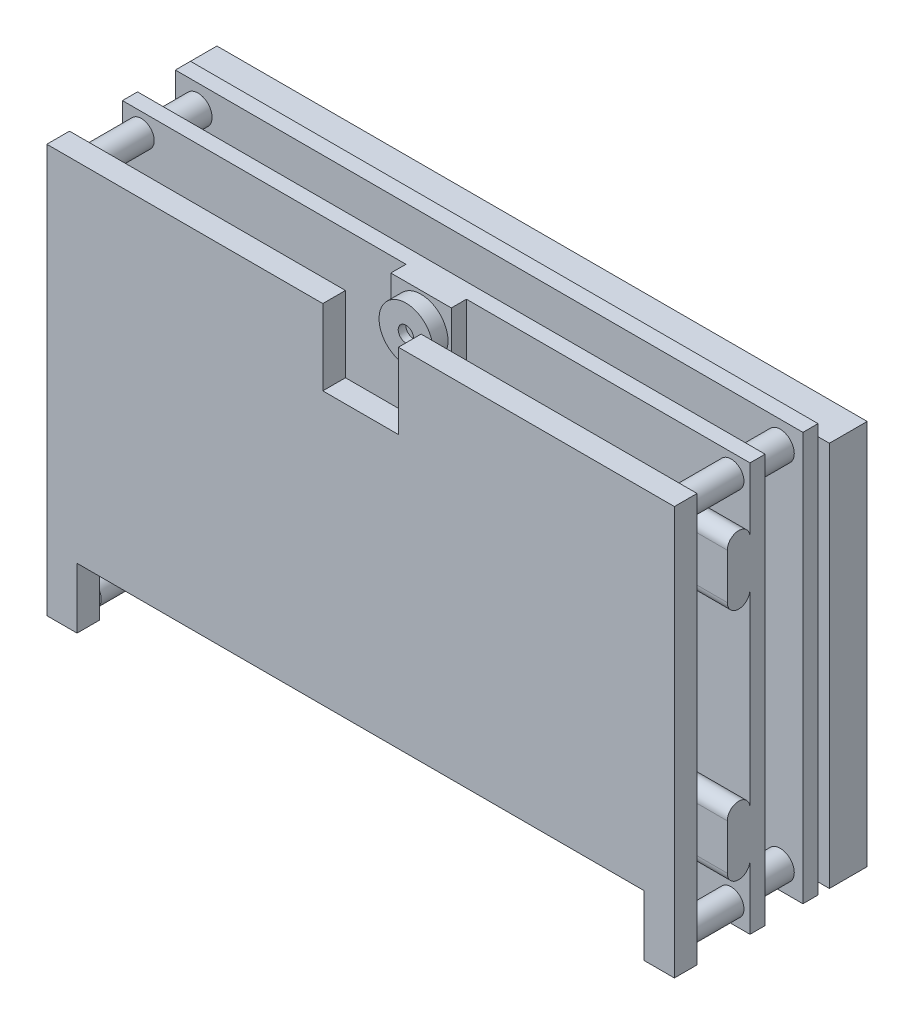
from build123d import *

# Parameters (mm, degrees)
SKETCH_1_W          = 83
SKETCH_1_H          = 54
EXTRUDE_1_DEPTH     = 3
SKETCH_2_W          = 10
SKETCH_2_H          = 10
CUT_EXTRUDE_1_DEPTH = 50.60090725
SKETCH_3_W          = 54
SKETCH_3_H          = 8
CUT_EXTRUDE_2_DEPTH = 50.60090725
SKETCH_4_R          = 1.7
EXTRUDE_2_DEPTH     = 7
SKETCH_5_W          = 83
SKETCH_5_H          = 54
EXTRUDE_3_DEPTH     = 2
SKETCH_6_W          = 8
SKETCH_6_H          = 8
EXTRUDE_4_DEPTH     = 2
SKETCH_7_R          = 3.559378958
EXTRUDE_5_DEPTH     = 2
SKETCH_8_R          = 1.02290573
CUT_EXTRUDE_3_DEPTH = 1
EXTRUDE_6_DEPTH     = 7
SKETCH_11_W         = 11
SKETCH_11_H         = 16
EXTRUDE_7_DEPTH     = 14
SKETCH_12_R         = 1.857430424
EXTRUDE_8_DEPTH     = 5
SKETCH_13_W         = 83
SKETCH_13_H         = 54
EXTRUDE_9_DEPTH     = 2
SKETCH_14_W         = 86
SKETCH_14_H         = 51
EXTRUDE_10_DEPTH    = 5


with BuildPart() as part:
    # Sketch 1 → Extrude 1 (new body)
    with BuildSketch(Plane.XY):
        Rectangle(SKETCH_1_W, SKETCH_1_H)
    extrude(amount=EXTRUDE_1_DEPTH)

    # Sketch 2 → Cut-Extrude 1 (cut, through all)
    with BuildSketch(Plane(origin=(0, 0, 0), x_dir=(-1, 0, 0), z_dir=(0, 0, -1))):
        with Locations((0, 22)):
            Rectangle(SKETCH_2_W, SKETCH_2_H)
    extrude(amount=-CUT_EXTRUDE_1_DEPTH, mode=Mode.SUBTRACT)

    # Sketch 3 → Cut-Extrude 2 (cut, through all)
    with BuildSketch(Plane(origin=(0, 0, 0), x_dir=(-1, 0, 0), z_dir=(0, 0, -1))):
        with Locations((10.5, -23)):
            Rectangle(SKETCH_3_W, SKETCH_3_H)
    cut_extrude_2 = extrude(amount=-CUT_EXTRUDE_2_DEPTH, mode=Mode.SUBTRACT)

    # Sketch 4 → Extrude 2 (add)
    with BuildSketch(Plane(origin=(0, 0, 0), x_dir=(-1, 0, 0), z_dir=(0, 0, -1))):
        with Locations(Location((-39, 24.5, 0), (0, 0, 180))):
            Circle(SKETCH_4_R)
        with Locations(Location((39, 24.5, 0), (0, 0, 180))):
            Circle(SKETCH_4_R)
        with Locations(Location((39, -24.5, 0), (0, 0, 208.072486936))):
            Circle(SKETCH_4_R)
        with Locations(Location((-39, -24.5, 0), (0, 0, 180))):
            Circle(SKETCH_4_R)
    extrude(amount=EXTRUDE_2_DEPTH)

    # Sketch 5 → Extrude 3 (add)
    with BuildSketch(Plane(origin=(0, 0, -7), x_dir=(-1, 0, 0), z_dir=(0, 0, -1))):
        Rectangle(SKETCH_5_W, SKETCH_5_H)
    extrude(amount=EXTRUDE_3_DEPTH)

    # Sketch 6 → Extrude 4 (add)
    with BuildSketch(Plane.XY.offset(-7)):
        with Locations((0, 23)):
            Rectangle(SKETCH_6_W, SKETCH_6_H)
    extrude(amount=EXTRUDE_4_DEPTH)

    # Sketch 7 → Extrude 5 (add)
    with BuildSketch(Plane.XY.offset(-5)):
        with Locations((0, 23)):
            Circle(SKETCH_7_R)
    extrude(amount=EXTRUDE_5_DEPTH)

    # Sketch 8 → Cut-Extrude 3 (cut)
    with BuildSketch(Plane.XY.offset(-3)):
        with Locations((0, 23)):
            Circle(SKETCH_8_R)
    extrude(amount=-CUT_EXTRUDE_3_DEPTH, mode=Mode.SUBTRACT)

    # Mirror 1: Cut-Extrude 2 across plane
    add(cut_extrude_2.mirror(Plane(origin=(0, 0, 0), x_dir=(0, 0, 1), z_dir=(1, 0, 0))), mode=Mode.SUBTRACT)

    # Sketch 10 → Extrude 6 (add)
    with BuildSketch(Plane(origin=(41.5, 0, 0), x_dir=(0, 0, -1), z_dir=(1, 0, 0))):
        with BuildLine():
            Line((7, 18.5), (7, 12.5))
            ThreePointArc((7, 12.5), (5.5, 11), (4, 12.5))
            Line((4, 12.5), (4, 18.5))
            ThreePointArc((4, 18.5), (5.5, 20), (7, 18.5))
        make_face()
    extrude_6 = extrude(amount=-EXTRUDE_6_DEPTH)

    # Mirror 2: Extrude 6 across plane
    add(extrude_6.mirror(Plane.ZX))

    # Sketch 11 → Extrude 7 (add)
    with BuildSketch(Plane.ZY.offset(41.5)):
        with Locations((-5.5, -3)):
            Rectangle(SKETCH_11_W, SKETCH_11_H)
    extrude(amount=-EXTRUDE_7_DEPTH)

    # Sketch 12 → Extrude 8 (add)
    with BuildSketch(Plane(origin=(0, 0, -9), x_dir=(-1, 0, 0), z_dir=(0, 0, -1))):
        with Locations(Location((-38.5, 24, 0), (0, 0, 180))):
            Circle(SKETCH_12_R)
        with Locations(Location((38.5, 24, 0), (0, 0, 180))):
            Circle(SKETCH_12_R)
        with Locations(Location((38.5, -24, 0), (0, 0, 180))):
            Circle(SKETCH_12_R)
        with Locations(Location((-38.5, -24, 0), (0, 0, 180))):
            Circle(SKETCH_12_R)
    extrude(amount=EXTRUDE_8_DEPTH)

    # Sketch 13 → Extrude 9 (add)
    with BuildSketch(Plane(origin=(0, 0, -14), x_dir=(-1, 0, 0), z_dir=(0, 0, -1))):
        Rectangle(SKETCH_13_W, SKETCH_13_H)
    extrude(amount=EXTRUDE_9_DEPTH)

    # Sketch 14 → Extrude 10 (add)
    with BuildSketch(Plane(origin=(0, 0, -16), x_dir=(-1, 0, 0), z_dir=(0, 0, -1))):
        Rectangle(SKETCH_14_W, SKETCH_14_H)
    extrude(amount=EXTRUDE_10_DEPTH)


solid = part.part
